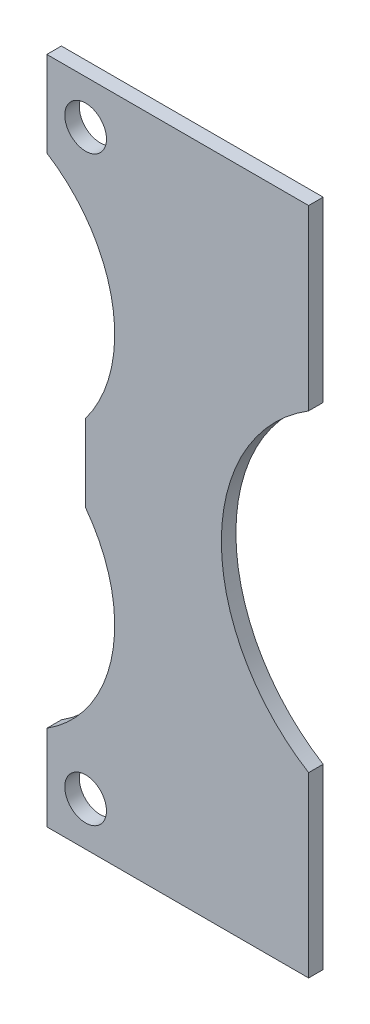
ISO-10303-21;
HEADER;
FILE_DESCRIPTION(('STEP AP214'),'2;1');
FILE_NAME('part.step','',(''),(''),'','','');
FILE_SCHEMA(('AUTOMOTIVE_DESIGN { 1 0 10303 214 1 1 1 1 }'));
ENDSEC;
DATA;
#1=APPLICATION_CONTEXT('core data for automotive mechanical design processes');
#2=APPLICATION_PROTOCOL_DEFINITION('international standard','automotive_design',2000,#1);
#3=PRODUCT_CONTEXT('',#1,'mechanical');
#4=PRODUCT('Part','Part','',(#3));
#5=PRODUCT_RELATED_PRODUCT_CATEGORY('part','',(#4));
#6=PRODUCT_DEFINITION_FORMATION('','',#4);
#7=PRODUCT_DEFINITION_CONTEXT('part definition',#1,'design');
#8=PRODUCT_DEFINITION('design','',#6,#7);
#9=PRODUCT_DEFINITION_SHAPE('','',#8);
#10=(LENGTH_UNIT() NAMED_UNIT(*) SI_UNIT(.MILLI.,.METRE.));
#11=(NAMED_UNIT(*) PLANE_ANGLE_UNIT() SI_UNIT($,.RADIAN.));
#12=(NAMED_UNIT(*) SI_UNIT($,.STERADIAN.) SOLID_ANGLE_UNIT());
#13=UNCERTAINTY_MEASURE_WITH_UNIT(LENGTH_MEASURE(1.E-05),#10,'distance_accuracy_value','');
#14=(GEOMETRIC_REPRESENTATION_CONTEXT(3) GLOBAL_UNCERTAINTY_ASSIGNED_CONTEXT((#13)) GLOBAL_UNIT_ASSIGNED_CONTEXT((#10,
#11,#12)) REPRESENTATION_CONTEXT('',''));
#15=CARTESIAN_POINT('',(0.,0.,0.));
#16=DIRECTION('',(0.,0.,1.));
#17=DIRECTION('',(1.,0.,0.));
#18=AXIS2_PLACEMENT_3D('',#15,#16,#17);
#19=CARTESIAN_POINT('',(0.,0.,0.));
#20=DIRECTION('',(0.,0.,1.));
#21=DIRECTION('',(1.,0.,0.));
#22=AXIS2_PLACEMENT_3D('',#19,#20,#21);
#23=PLANE('',#22);
#24=CARTESIAN_POINT('',(0.,-30.,0.));
#25=DIRECTION('',(0.,0.,1.));
#26=DIRECTION('',(1.,0.,0.));
#27=AXIS2_PLACEMENT_3D('',#24,#25,#26);
#28=CIRCLE('',#27,2.15);
#29=CARTESIAN_POINT('',(2.15,-30.,0.));
#30=VERTEX_POINT('',#29);
#31=EDGE_CURVE('E116',#30,#30,#28,.T.);
#32=ORIENTED_EDGE('',*,*,#31,.T.);
#33=EDGE_LOOP('',(#32));
#34=FACE_BOUND('',#33,.T.);
#35=CARTESIAN_POINT('',(0.,30.,0.));
#36=DIRECTION('',(0.,0.,1.));
#37=DIRECTION('',(1.,0.,0.));
#38=AXIS2_PLACEMENT_3D('',#35,#36,#37);
#39=CIRCLE('',#38,2.15);
#40=CARTESIAN_POINT('',(2.15,30.,0.));
#41=VERTEX_POINT('',#40);
#42=EDGE_CURVE('E113',#41,#41,#39,.T.);
#43=ORIENTED_EDGE('',*,*,#42,.T.);
#44=EDGE_LOOP('',(#43));
#45=FACE_BOUND('',#44,.T.);
#46=DIRECTION('',(0.,1.,0.));
#47=VECTOR('',#46,1.);
#48=CARTESIAN_POINT('',(23.,16.1554944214,0.));
#49=LINE('',#48,#47);
#50=CARTESIAN_POINT('',(23.,16.1554944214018,0.));
#51=VERTEX_POINT('',#50);
#52=CARTESIAN_POINT('',(23.,34.5,0.));
#53=VERTEX_POINT('',#52);
#54=EDGE_CURVE('E128',#51,#53,#49,.T.);
#55=ORIENTED_EDGE('',*,*,#54,.F.);
#56=CARTESIAN_POINT('',(33.,0.,0.));
#57=DIRECTION('',(0.,0.,1.));
#58=DIRECTION('',(1.,0.,0.));
#59=AXIS2_PLACEMENT_3D('',#56,#57,#58);
#60=CIRCLE('',#59,19.);
#61=CARTESIAN_POINT('',(22.9999999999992,-16.155494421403,0.));
#62=VERTEX_POINT('',#61);
#63=EDGE_CURVE('E136',#51,#62,#60,.T.);
#64=ORIENTED_EDGE('',*,*,#63,.T.);
#65=DIRECTION('',(0.,1.,0.));
#66=VECTOR('',#65,1.);
#67=CARTESIAN_POINT('',(23.,-34.5,0.));
#68=LINE('',#67,#66);
#69=CARTESIAN_POINT('',(23.,-34.5,0.));
#70=VERTEX_POINT('',#69);
#71=EDGE_CURVE('E133',#70,#62,#68,.T.);
#72=ORIENTED_EDGE('',*,*,#71,.F.);
#73=DIRECTION('',(1.,0.,0.));
#74=VECTOR('',#73,1.);
#75=CARTESIAN_POINT('',(-4.,-34.5,0.));
#76=LINE('',#75,#74);
#77=CARTESIAN_POINT('',(-4.,-34.5,0.));
#78=VERTEX_POINT('',#77);
#79=EDGE_CURVE('E140',#78,#70,#76,.T.);
#80=ORIENTED_EDGE('',*,*,#79,.F.);
#81=DIRECTION('',(0.,1.,0.));
#82=VECTOR('',#81,1.);
#83=CARTESIAN_POINT('',(-4.,-25.68857754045,0.));
#84=LINE('',#83,#82);
#85=CARTESIAN_POINT('',(-4.,-25.6885775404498,0.));
#86=VERTEX_POINT('',#85);
#87=EDGE_CURVE('E145',#86,#78,#84,.F.);
#88=ORIENTED_EDGE('',*,*,#87,.F.);
#89=CARTESIAN_POINT('',(-12.,-13.,0.));
#90=DIRECTION('',(0.,0.,1.));
#91=DIRECTION('',(1.,0.,0.));
#92=AXIS2_PLACEMENT_3D('',#89,#90,#91);
#93=CIRCLE('',#92,15.);
#94=CARTESIAN_POINT('',(0.,-4.,0.));
#95=VERTEX_POINT('',#94);
#96=EDGE_CURVE('E150',#86,#95,#93,.T.);
#97=ORIENTED_EDGE('',*,*,#96,.T.);
#98=DIRECTION('',(0.,1.,0.));
#99=VECTOR('',#98,1.);
#100=CARTESIAN_POINT('',(0.,4.,0.));
#101=LINE('',#100,#99);
#102=CARTESIAN_POINT('',(0.,4.,0.));
#103=VERTEX_POINT('',#102);
#104=EDGE_CURVE('E99',#103,#95,#101,.F.);
#105=ORIENTED_EDGE('',*,*,#104,.F.);
#106=CARTESIAN_POINT('',(-12.,13.,0.));
#107=DIRECTION('',(0.,0.,1.));
#108=DIRECTION('',(1.,0.,0.));
#109=AXIS2_PLACEMENT_3D('',#106,#107,#108);
#110=CIRCLE('',#109,15.);
#111=CARTESIAN_POINT('',(-4.,25.6885775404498,0.));
#112=VERTEX_POINT('',#111);
#113=EDGE_CURVE('E21',#103,#112,#110,.T.);
#114=ORIENTED_EDGE('',*,*,#113,.T.);
#115=DIRECTION('',(0.,1.,0.));
#116=VECTOR('',#115,1.);
#117=CARTESIAN_POINT('',(-4.,34.5,0.));
#118=LINE('',#117,#116);
#119=CARTESIAN_POINT('',(-4.,34.5,0.));
#120=VERTEX_POINT('',#119);
#121=EDGE_CURVE('E97',#120,#112,#118,.F.);
#122=ORIENTED_EDGE('',*,*,#121,.F.);
#123=DIRECTION('',(1.,0.,0.));
#124=VECTOR('',#123,1.);
#125=CARTESIAN_POINT('',(23.,34.5,0.));
#126=LINE('',#125,#124);
#127=EDGE_CURVE('E110',#53,#120,#126,.F.);
#128=ORIENTED_EDGE('',*,*,#127,.F.);
#129=EDGE_LOOP('',(#55,#64,#72,#80,#88,#97,#105,#114,#122,#128));
#130=FACE_BOUND('',#129,.T.);
#131=ADVANCED_FACE('F17',(#34,#45,#130),#23,.F.);
#132=CARTESIAN_POINT('',(-12.,13.,0.));
#133=DIRECTION('',(0.,0.,1.));
#134=DIRECTION('',(1.,0.,0.));
#135=AXIS2_PLACEMENT_3D('',#132,#133,#134);
#136=CYLINDRICAL_SURFACE('',#135,15.);
#137=DIRECTION('',(0.,0.,1.));
#138=VECTOR('',#137,1.);
#139=CARTESIAN_POINT('',(0.,4.,0.));
#140=LINE('',#139,#138);
#141=CARTESIAN_POINT('',(0.,4.,1.5));
#142=VERTEX_POINT('',#141);
#143=EDGE_CURVE('E103',#142,#103,#140,.F.);
#144=ORIENTED_EDGE('',*,*,#143,.F.);
#145=CARTESIAN_POINT('',(-12.,13.,1.5));
#146=DIRECTION('',(0.,0.,1.));
#147=DIRECTION('',(1.,0.,0.));
#148=AXIS2_PLACEMENT_3D('',#145,#146,#147);
#149=CIRCLE('',#148,15.);
#150=CARTESIAN_POINT('',(-4.,25.6885775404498,1.5));
#151=VERTEX_POINT('',#150);
#152=EDGE_CURVE('E107',#151,#142,#149,.F.);
#153=ORIENTED_EDGE('',*,*,#152,.F.);
#154=DIRECTION('',(0.,0.,1.));
#155=VECTOR('',#154,1.);
#156=CARTESIAN_POINT('',(-4.,25.68857754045,0.));
#157=LINE('',#156,#155);
#158=EDGE_CURVE('E105',#112,#151,#157,.T.);
#159=ORIENTED_EDGE('',*,*,#158,.F.);
#160=ORIENTED_EDGE('',*,*,#113,.F.);
#161=EDGE_LOOP('',(#144,#153,#159,#160));
#162=FACE_BOUND('',#161,.T.);
#163=ADVANCED_FACE('F106',(#162),#136,.F.);
#164=CARTESIAN_POINT('',(0.,4.,0.));
#165=DIRECTION('',(-1.,0.,0.));
#166=DIRECTION('',(0.,0.,1.));
#167=AXIS2_PLACEMENT_3D('',#164,#165,#166);
#168=PLANE('',#167);
#169=ORIENTED_EDGE('',*,*,#143,.T.);
#170=ORIENTED_EDGE('',*,*,#104,.T.);
#171=DIRECTION('',(0.,0.,1.));
#172=VECTOR('',#171,1.);
#173=CARTESIAN_POINT('',(0.,-4.,0.));
#174=LINE('',#173,#172);
#175=CARTESIAN_POINT('',(0.,-4.,1.5));
#176=VERTEX_POINT('',#175);
#177=EDGE_CURVE('E167',#95,#176,#174,.T.);
#178=ORIENTED_EDGE('',*,*,#177,.T.);
#179=DIRECTION('',(0.,1.,0.));
#180=VECTOR('',#179,1.);
#181=CARTESIAN_POINT('',(0.,0.,1.5));
#182=LINE('',#181,#180);
#183=EDGE_CURVE('E162',#142,#176,#182,.F.);
#184=ORIENTED_EDGE('',*,*,#183,.F.);
#185=EDGE_LOOP('',(#169,#170,#178,#184));
#186=FACE_BOUND('',#185,.T.);
#187=ADVANCED_FACE('F243',(#186),#168,.T.);
#188=CARTESIAN_POINT('',(-12.,-13.,0.));
#189=DIRECTION('',(0.,0.,1.));
#190=DIRECTION('',(1.,0.,0.));
#191=AXIS2_PLACEMENT_3D('',#188,#189,#190);
#192=CYLINDRICAL_SURFACE('',#191,15.);
#193=DIRECTION('',(0.,0.,1.));
#194=VECTOR('',#193,1.);
#195=CARTESIAN_POINT('',(-4.,-25.68857754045,0.));
#196=LINE('',#195,#194);
#197=CARTESIAN_POINT('',(-4.,-25.6885775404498,1.5));
#198=VERTEX_POINT('',#197);
#199=EDGE_CURVE('E147',#198,#86,#196,.F.);
#200=ORIENTED_EDGE('',*,*,#199,.F.);
#201=CARTESIAN_POINT('',(-12.,-13.,1.5));
#202=DIRECTION('',(0.,0.,1.));
#203=DIRECTION('',(1.,0.,0.));
#204=AXIS2_PLACEMENT_3D('',#201,#202,#203);
#205=CIRCLE('',#204,15.);
#206=EDGE_CURVE('E159',#176,#198,#205,.F.);
#207=ORIENTED_EDGE('',*,*,#206,.F.);
#208=ORIENTED_EDGE('',*,*,#177,.F.);
#209=ORIENTED_EDGE('',*,*,#96,.F.);
#210=EDGE_LOOP('',(#200,#207,#208,#209));
#211=FACE_BOUND('',#210,.T.);
#212=ADVANCED_FACE('F242',(#211),#192,.F.);
#213=CARTESIAN_POINT('',(-4.,-25.68857754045,0.));
#214=DIRECTION('',(-1.,0.,0.));
#215=DIRECTION('',(0.,0.,1.));
#216=AXIS2_PLACEMENT_3D('',#213,#214,#215);
#217=PLANE('',#216);
#218=ORIENTED_EDGE('',*,*,#199,.T.);
#219=ORIENTED_EDGE('',*,*,#87,.T.);
#220=DIRECTION('',(0.,0.,-1.));
#221=VECTOR('',#220,1.);
#222=CARTESIAN_POINT('',(-4.,-34.5,0.));
#223=LINE('',#222,#221);
#224=CARTESIAN_POINT('',(-4.,-34.5,1.5));
#225=VERTEX_POINT('',#224);
#226=EDGE_CURVE('E142',#225,#78,#223,.T.);
#227=ORIENTED_EDGE('',*,*,#226,.F.);
#228=DIRECTION('',(0.,1.,0.));
#229=VECTOR('',#228,1.);
#230=CARTESIAN_POINT('',(-4.,0.,1.5));
#231=LINE('',#230,#229);
#232=EDGE_CURVE('E161',#198,#225,#231,.F.);
#233=ORIENTED_EDGE('',*,*,#232,.F.);
#234=EDGE_LOOP('',(#218,#219,#227,#233));
#235=FACE_BOUND('',#234,.T.);
#236=ADVANCED_FACE('F240',(#235),#217,.T.);
#237=CARTESIAN_POINT('',(-4.,-34.5,0.));
#238=DIRECTION('',(0.,-1.,0.));
#239=DIRECTION('',(0.,0.,-1.));
#240=AXIS2_PLACEMENT_3D('',#237,#238,#239);
#241=PLANE('',#240);
#242=ORIENTED_EDGE('',*,*,#226,.T.);
#243=ORIENTED_EDGE('',*,*,#79,.T.);
#244=DIRECTION('',(0.,0.,-1.));
#245=VECTOR('',#244,1.);
#246=CARTESIAN_POINT('',(23.,-34.5,0.));
#247=LINE('',#246,#245);
#248=CARTESIAN_POINT('',(23.,-34.5,1.5));
#249=VERTEX_POINT('',#248);
#250=EDGE_CURVE('E137',#249,#70,#247,.T.);
#251=ORIENTED_EDGE('',*,*,#250,.F.);
#252=DIRECTION('',(1.,0.,0.));
#253=VECTOR('',#252,1.);
#254=CARTESIAN_POINT('',(0.,-34.5,1.5));
#255=LINE('',#254,#253);
#256=EDGE_CURVE('E182',#225,#249,#255,.T.);
#257=ORIENTED_EDGE('',*,*,#256,.F.);
#258=EDGE_LOOP('',(#242,#243,#251,#257));
#259=FACE_BOUND('',#258,.T.);
#260=ADVANCED_FACE('F237',(#259),#241,.T.);
#261=CARTESIAN_POINT('',(23.,-34.5,0.));
#262=DIRECTION('',(1.,0.,0.));
#263=DIRECTION('',(0.,0.,-1.));
#264=AXIS2_PLACEMENT_3D('',#261,#262,#263);
#265=PLANE('',#264);
#266=ORIENTED_EDGE('',*,*,#250,.T.);
#267=ORIENTED_EDGE('',*,*,#71,.T.);
#268=DIRECTION('',(0.,0.,1.));
#269=VECTOR('',#268,1.);
#270=CARTESIAN_POINT('',(22.9999999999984,-16.1554944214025,0.));
#271=LINE('',#270,#269);
#272=CARTESIAN_POINT('',(22.9999999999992,-16.155494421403,1.5));
#273=VERTEX_POINT('',#272);
#274=EDGE_CURVE('E166',#62,#273,#271,.T.);
#275=ORIENTED_EDGE('',*,*,#274,.T.);
#276=DIRECTION('',(0.,1.,0.));
#277=VECTOR('',#276,1.);
#278=CARTESIAN_POINT('',(23.,0.,1.5));
#279=LINE('',#278,#277);
#280=EDGE_CURVE('E158',#249,#273,#279,.T.);
#281=ORIENTED_EDGE('',*,*,#280,.F.);
#282=EDGE_LOOP('',(#266,#267,#275,#281));
#283=FACE_BOUND('',#282,.T.);
#284=ADVANCED_FACE('F230',(#283),#265,.T.);
#285=CARTESIAN_POINT('',(33.,0.,0.));
#286=DIRECTION('',(0.,0.,1.));
#287=DIRECTION('',(1.,0.,0.));
#288=AXIS2_PLACEMENT_3D('',#285,#286,#287);
#289=CYLINDRICAL_SURFACE('',#288,19.);
#290=DIRECTION('',(0.,0.,-1.));
#291=VECTOR('',#290,1.);
#292=CARTESIAN_POINT('',(23.,16.1554944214,0.));
#293=LINE('',#292,#291);
#294=CARTESIAN_POINT('',(23.,16.1554944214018,1.5));
#295=VERTEX_POINT('',#294);
#296=EDGE_CURVE('E130',#295,#51,#293,.T.);
#297=ORIENTED_EDGE('',*,*,#296,.F.);
#298=CARTESIAN_POINT('',(33.,0.,1.5));
#299=DIRECTION('',(0.,0.,1.));
#300=DIRECTION('',(1.,0.,0.));
#301=AXIS2_PLACEMENT_3D('',#298,#299,#300);
#302=CIRCLE('',#301,19.);
#303=EDGE_CURVE('E155',#273,#295,#302,.F.);
#304=ORIENTED_EDGE('',*,*,#303,.F.);
#305=ORIENTED_EDGE('',*,*,#274,.F.);
#306=ORIENTED_EDGE('',*,*,#63,.F.);
#307=EDGE_LOOP('',(#297,#304,#305,#306));
#308=FACE_BOUND('',#307,.T.);
#309=ADVANCED_FACE('F233',(#308),#289,.F.);
#310=CARTESIAN_POINT('',(23.,16.1554944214,0.));
#311=DIRECTION('',(1.,0.,0.));
#312=DIRECTION('',(0.,0.,-1.));
#313=AXIS2_PLACEMENT_3D('',#310,#311,#312);
#314=PLANE('',#313);
#315=ORIENTED_EDGE('',*,*,#296,.T.);
#316=ORIENTED_EDGE('',*,*,#54,.T.);
#317=DIRECTION('',(0.,0.,1.));
#318=VECTOR('',#317,1.);
#319=CARTESIAN_POINT('',(23.,34.5,0.));
#320=LINE('',#319,#318);
#321=CARTESIAN_POINT('',(23.,34.5,1.5));
#322=VERTEX_POINT('',#321);
#323=EDGE_CURVE('E125',#322,#53,#320,.F.);
#324=ORIENTED_EDGE('',*,*,#323,.F.);
#325=DIRECTION('',(0.,1.,0.));
#326=VECTOR('',#325,1.);
#327=CARTESIAN_POINT('',(23.,0.,1.5));
#328=LINE('',#327,#326);
#329=EDGE_CURVE('E157',#295,#322,#328,.T.);
#330=ORIENTED_EDGE('',*,*,#329,.F.);
#331=EDGE_LOOP('',(#315,#316,#324,#330));
#332=FACE_BOUND('',#331,.T.);
#333=ADVANCED_FACE('F223',(#332),#314,.T.);
#334=CARTESIAN_POINT('',(23.,34.5,0.));
#335=DIRECTION('',(0.,1.,0.));
#336=DIRECTION('',(0.,0.,1.));
#337=AXIS2_PLACEMENT_3D('',#334,#335,#336);
#338=PLANE('',#337);
#339=ORIENTED_EDGE('',*,*,#323,.T.);
#340=ORIENTED_EDGE('',*,*,#127,.T.);
#341=DIRECTION('',(0.,0.,1.));
#342=VECTOR('',#341,1.);
#343=CARTESIAN_POINT('',(-4.,34.5,0.));
#344=LINE('',#343,#342);
#345=CARTESIAN_POINT('',(-4.,34.5,1.5));
#346=VERTEX_POINT('',#345);
#347=EDGE_CURVE('E36',#346,#120,#344,.F.);
#348=ORIENTED_EDGE('',*,*,#347,.F.);
#349=DIRECTION('',(1.,0.,0.));
#350=VECTOR('',#349,1.);
#351=CARTESIAN_POINT('',(0.,34.5,1.5));
#352=LINE('',#351,#350);
#353=EDGE_CURVE('E198',#322,#346,#352,.F.);
#354=ORIENTED_EDGE('',*,*,#353,.F.);
#355=EDGE_LOOP('',(#339,#340,#348,#354));
#356=FACE_BOUND('',#355,.T.);
#357=ADVANCED_FACE('F221',(#356),#338,.T.);
#358=CARTESIAN_POINT('',(-4.,34.5,0.));
#359=DIRECTION('',(-1.,0.,0.));
#360=DIRECTION('',(0.,0.,1.));
#361=AXIS2_PLACEMENT_3D('',#358,#359,#360);
#362=PLANE('',#361);
#363=ORIENTED_EDGE('',*,*,#347,.T.);
#364=ORIENTED_EDGE('',*,*,#121,.T.);
#365=ORIENTED_EDGE('',*,*,#158,.T.);
#366=DIRECTION('',(0.,1.,0.));
#367=VECTOR('',#366,1.);
#368=CARTESIAN_POINT('',(-4.,0.,1.5));
#369=LINE('',#368,#367);
#370=EDGE_CURVE('E154',#346,#151,#369,.F.);
#371=ORIENTED_EDGE('',*,*,#370,.F.);
#372=EDGE_LOOP('',(#363,#364,#365,#371));
#373=FACE_BOUND('',#372,.T.);
#374=ADVANCED_FACE('F112',(#373),#362,.T.);
#375=CARTESIAN_POINT('',(0.,30.,0.));
#376=DIRECTION('',(0.,0.,1.));
#377=DIRECTION('',(1.,0.,0.));
#378=AXIS2_PLACEMENT_3D('',#375,#376,#377);
#379=CYLINDRICAL_SURFACE('',#378,2.15);
#380=CARTESIAN_POINT('',(0.,30.,1.5));
#381=DIRECTION('',(0.,0.,1.));
#382=DIRECTION('',(1.,0.,0.));
#383=AXIS2_PLACEMENT_3D('',#380,#381,#382);
#384=CIRCLE('',#383,2.15);
#385=CARTESIAN_POINT('',(2.15,30.,1.5));
#386=VERTEX_POINT('',#385);
#387=EDGE_CURVE('E27',#386,#386,#384,.F.);
#388=ORIENTED_EDGE('',*,*,#387,.F.);
#389=EDGE_LOOP('',(#388));
#390=FACE_BOUND('',#389,.T.);
#391=ORIENTED_EDGE('',*,*,#42,.F.);
#392=EDGE_LOOP('',(#391));
#393=FACE_BOUND('',#392,.T.);
#394=ADVANCED_FACE('F259',(#390,#393),#379,.F.);
#395=CARTESIAN_POINT('',(0.,-30.,0.));
#396=DIRECTION('',(0.,0.,1.));
#397=DIRECTION('',(1.,0.,0.));
#398=AXIS2_PLACEMENT_3D('',#395,#396,#397);
#399=CYLINDRICAL_SURFACE('',#398,2.15);
#400=CARTESIAN_POINT('',(0.,-30.,1.5));
#401=DIRECTION('',(0.,0.,1.));
#402=DIRECTION('',(1.,0.,0.));
#403=AXIS2_PLACEMENT_3D('',#400,#401,#402);
#404=CIRCLE('',#403,2.15);
#405=CARTESIAN_POINT('',(2.15,-30.,1.5));
#406=VERTEX_POINT('',#405);
#407=EDGE_CURVE('E11',#406,#406,#404,.F.);
#408=ORIENTED_EDGE('',*,*,#407,.F.);
#409=EDGE_LOOP('',(#408));
#410=FACE_BOUND('',#409,.T.);
#411=ORIENTED_EDGE('',*,*,#31,.F.);
#412=EDGE_LOOP('',(#411));
#413=FACE_BOUND('',#412,.T.);
#414=ADVANCED_FACE('F254',(#410,#413),#399,.F.);
#415=CARTESIAN_POINT('',(0.,0.,1.5));
#416=DIRECTION('',(0.,0.,1.));
#417=DIRECTION('',(1.,0.,0.));
#418=AXIS2_PLACEMENT_3D('',#415,#416,#417);
#419=PLANE('',#418);
#420=ORIENTED_EDGE('',*,*,#407,.T.);
#421=EDGE_LOOP('',(#420));
#422=FACE_BOUND('',#421,.T.);
#423=ORIENTED_EDGE('',*,*,#387,.T.);
#424=EDGE_LOOP('',(#423));
#425=FACE_BOUND('',#424,.T.);
#426=ORIENTED_EDGE('',*,*,#353,.T.);
#427=ORIENTED_EDGE('',*,*,#370,.T.);
#428=ORIENTED_EDGE('',*,*,#152,.T.);
#429=ORIENTED_EDGE('',*,*,#183,.T.);
#430=ORIENTED_EDGE('',*,*,#206,.T.);
#431=ORIENTED_EDGE('',*,*,#232,.T.);
#432=ORIENTED_EDGE('',*,*,#256,.T.);
#433=ORIENTED_EDGE('',*,*,#280,.T.);
#434=ORIENTED_EDGE('',*,*,#303,.T.);
#435=ORIENTED_EDGE('',*,*,#329,.T.);
#436=EDGE_LOOP('',(#426,#427,#428,#429,#430,#431,#432,#433,#434,#435));
#437=FACE_BOUND('',#436,.T.);
#438=ADVANCED_FACE('F19',(#422,#425,#437),#419,.T.);
#439=CLOSED_SHELL('',(#131,#163,#187,#212,#236,#260,#284,#309,#333,#357,#374,#394,#414,#438));
#440=MANIFOLD_SOLID_BREP('B1',#439);
#441=ADVANCED_BREP_SHAPE_REPRESENTATION('',(#18,#440),#14);
#442=SHAPE_DEFINITION_REPRESENTATION(#9,#441);
ENDSEC;
END-ISO-10303-21;
